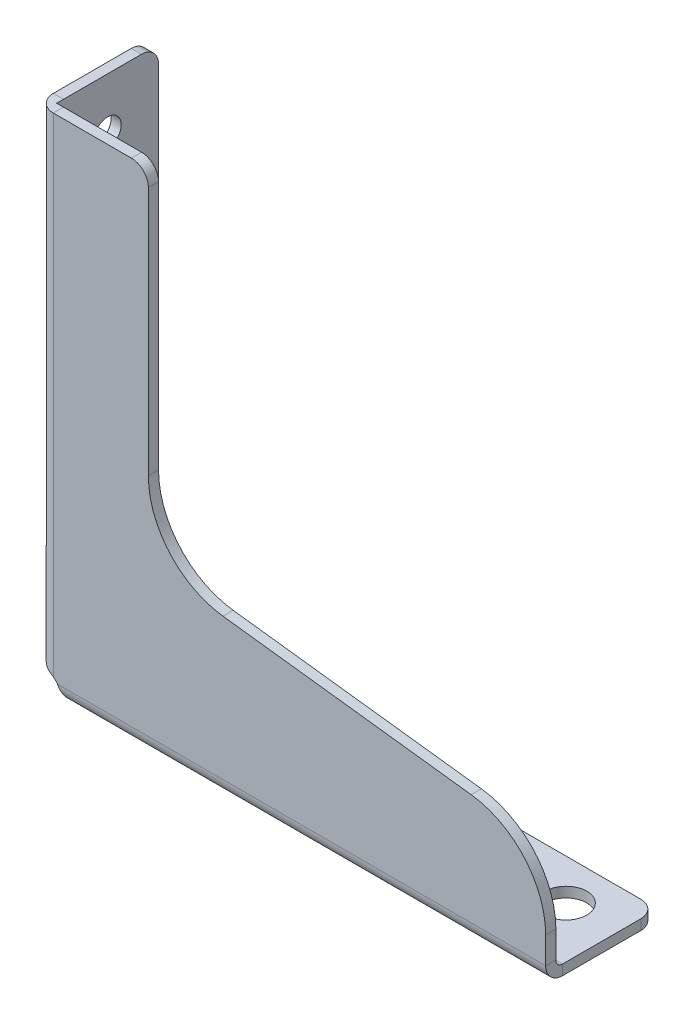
ISO-10303-21;
HEADER;
FILE_DESCRIPTION(('STEP AP214'),'2;1');
FILE_NAME('part.step','',(''),(''),'','','');
FILE_SCHEMA(('AUTOMOTIVE_DESIGN { 1 0 10303 214 1 1 1 1 }'));
ENDSEC;
DATA;
#1=APPLICATION_CONTEXT('core data for automotive mechanical design processes');
#2=APPLICATION_PROTOCOL_DEFINITION('international standard','automotive_design',2000,#1);
#3=PRODUCT_CONTEXT('',#1,'mechanical');
#4=PRODUCT('Part','Part','',(#3));
#5=PRODUCT_RELATED_PRODUCT_CATEGORY('part','',(#4));
#6=PRODUCT_DEFINITION_FORMATION('','',#4);
#7=PRODUCT_DEFINITION_CONTEXT('part definition',#1,'design');
#8=PRODUCT_DEFINITION('design','',#6,#7);
#9=PRODUCT_DEFINITION_SHAPE('','',#8);
#10=(LENGTH_UNIT() NAMED_UNIT(*) SI_UNIT(.MILLI.,.METRE.));
#11=(NAMED_UNIT(*) PLANE_ANGLE_UNIT() SI_UNIT($,.RADIAN.));
#12=(NAMED_UNIT(*) SI_UNIT($,.STERADIAN.) SOLID_ANGLE_UNIT());
#13=UNCERTAINTY_MEASURE_WITH_UNIT(LENGTH_MEASURE(1.E-05),#10,'distance_accuracy_value','');
#14=(GEOMETRIC_REPRESENTATION_CONTEXT(3) GLOBAL_UNCERTAINTY_ASSIGNED_CONTEXT((#13)) GLOBAL_UNIT_ASSIGNED_CONTEXT((#10,
#11,#12)) REPRESENTATION_CONTEXT('',''));
#15=CARTESIAN_POINT('',(0.,0.,0.));
#16=DIRECTION('',(0.,0.,1.));
#17=DIRECTION('',(1.,0.,0.));
#18=AXIS2_PLACEMENT_3D('',#15,#16,#17);
#19=CARTESIAN_POINT('',(44.1785365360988,64.4558627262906,0.));
#20=DIRECTION('',(0.,0.,-1.));
#21=DIRECTION('',(-1.,0.,0.));
#22=AXIS2_PLACEMENT_3D('',#19,#20,#21);
#23=PLANE('',#22);
#24=DIRECTION('',(-1.,0.,0.));
#25=VECTOR('',#24,1.);
#26=CARTESIAN_POINT('',(-42.3214634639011,142.971937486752,0.));
#27=LINE('',#26,#25);
#28=CARTESIAN_POINT('',(14.1785365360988,142.971937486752,0.));
#29=VERTEX_POINT('',#28);
#30=CARTESIAN_POINT('',(-8.82146346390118,142.971937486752,0.));
#31=VERTEX_POINT('',#30);
#32=EDGE_CURVE('E246',#29,#31,#27,.T.);
#33=ORIENTED_EDGE('',*,*,#32,.F.);
#34=CARTESIAN_POINT('',(14.1785365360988,137.971937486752,0.));
#35=DIRECTION('',(0.,0.,-1.));
#36=DIRECTION('',(-1.,0.,0.));
#37=AXIS2_PLACEMENT_3D('',#34,#35,#36);
#38=CIRCLE('',#37,5.);
#39=CARTESIAN_POINT('',(19.1785365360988,137.971937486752,0.));
#40=VERTEX_POINT('',#39);
#41=EDGE_CURVE('E81',#29,#40,#38,.T.);
#42=ORIENTED_EDGE('',*,*,#41,.T.);
#43=DIRECTION('',(0.,1.,0.));
#44=VECTOR('',#43,1.);
#45=CARTESIAN_POINT('',(19.1785365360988,142.971937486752,0.));
#46=LINE('',#45,#44);
#47=CARTESIAN_POINT('',(19.1785365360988,64.4558627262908,0.));
#48=VERTEX_POINT('',#47);
#49=EDGE_CURVE('E253',#48,#40,#46,.T.);
#50=ORIENTED_EDGE('',*,*,#49,.F.);
#51=CARTESIAN_POINT('',(44.1785365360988,64.4558627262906,0.));
#52=DIRECTION('',(0.,0.,-1.));
#53=DIRECTION('',(-1.,0.,0.));
#54=AXIS2_PLACEMENT_3D('',#51,#52,#53);
#55=CIRCLE('',#54,25.);
#56=CARTESIAN_POINT('',(41.1318029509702,39.6422089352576,0.));
#57=VERTEX_POINT('',#56);
#58=EDGE_CURVE('E511',#57,#48,#55,.T.);
#59=ORIENTED_EDGE('',*,*,#58,.F.);
#60=DIRECTION('',(-0.992546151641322,0.12186934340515,0.));
#61=VECTOR('',#60,1.);
#62=CARTESIAN_POINT('',(114.225270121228,30.6674596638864,0.));
#63=LINE('',#62,#61);
#64=CARTESIAN_POINT('',(114.225270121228,30.6674596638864,0.));
#65=VERTEX_POINT('',#64);
#66=EDGE_CURVE('E506',#65,#57,#63,.T.);
#67=ORIENTED_EDGE('',*,*,#66,.F.);
#68=CARTESIAN_POINT('',(111.178536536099,5.8538058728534,0.));
#69=DIRECTION('',(0.,0.,1.));
#70=DIRECTION('',(1.,0.,0.));
#71=AXIS2_PLACEMENT_3D('',#68,#69,#70);
#72=CIRCLE('',#71,25.);
#73=CARTESIAN_POINT('',(136.178536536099,5.85380587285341,0.));
#74=VERTEX_POINT('',#73);
#75=EDGE_CURVE('E501',#74,#65,#72,.T.);
#76=ORIENTED_EDGE('',*,*,#75,.F.);
#77=DIRECTION('',(0.,1.,0.));
#78=VECTOR('',#77,1.);
#79=CARTESIAN_POINT('',(136.178536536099,5.85380587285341,0.));
#80=LINE('',#79,#78);
#81=CARTESIAN_POINT('',(136.178536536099,-2.02806251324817,0.));
#82=VERTEX_POINT('',#81);
#83=EDGE_CURVE('E500',#82,#74,#80,.T.);
#84=ORIENTED_EDGE('',*,*,#83,.F.);
#85=DIRECTION('',(-1.,0.,0.));
#86=VECTOR('',#85,1.);
#87=CARTESIAN_POINT('',(44.1785365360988,-2.02806251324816,0.));
#88=LINE('',#87,#86);
#89=CARTESIAN_POINT('',(-7.58990488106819,-2.02806251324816,0.));
#90=VERTEX_POINT('',#89);
#91=EDGE_CURVE('E242',#82,#90,#88,.T.);
#92=ORIENTED_EDGE('',*,*,#91,.T.);
#93=CARTESIAN_POINT('',(-13.4731138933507,-6.67971294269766,0.));
#94=DIRECTION('',(0.,0.,-1.));
#95=DIRECTION('',(1.,0.,0.));
#96=AXIS2_PLACEMENT_3D('',#93,#94,#95);
#97=CIRCLE('',#96,7.49999999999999);
#98=CARTESIAN_POINT('',(-8.82146346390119,-0.796503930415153,0.));
#99=VERTEX_POINT('',#98);
#100=EDGE_CURVE('E240',#99,#90,#97,.T.);
#101=ORIENTED_EDGE('',*,*,#100,.F.);
#102=CARTESIAN_POINT('',(-10.8214634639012,0.575904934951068,0.));
#103=CARTESIAN_POINT('',(-10.7928154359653,0.569403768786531,0.));
#104=CARTESIAN_POINT('',(-10.7642527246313,0.562539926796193,0.));
#105=CARTESIAN_POINT('',(-10.7072961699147,0.548136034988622,0.));
#106=CARTESIAN_POINT('',(-10.6789023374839,0.540595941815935,0.));
#107=CARTESIAN_POINT('',(-10.5938589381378,0.517003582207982,0.));
#108=CARTESIAN_POINT('',(-10.5374669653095,0.500006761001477,0.));
#109=CARTESIAN_POINT('',(-10.4255973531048,0.463118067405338,0.));
#110=CARTESIAN_POINT('',(-10.3701202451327,0.443224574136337,0.));
#111=CARTESIAN_POINT('',(-10.2611947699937,0.400644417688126,0.));
#112=CARTESIAN_POINT('',(-10.2077284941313,0.378003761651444,0.));
#113=CARTESIAN_POINT('',(-10.1022841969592,0.32957262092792,0.));
#114=CARTESIAN_POINT('',(-10.0503051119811,0.303784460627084,0.));
#115=CARTESIAN_POINT('',(-9.9480741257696,0.249043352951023,0.));
#116=CARTESIAN_POINT('',(-9.89782145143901,0.220091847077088,0.));
#117=CARTESIAN_POINT('',(-9.77404094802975,0.143536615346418,0.));
#118=CARTESIAN_POINT('',(-9.70172596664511,0.0939553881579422,0.));
#119=CARTESIAN_POINT('',(-9.56176171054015,-0.0114246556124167,0.));
#120=CARTESIAN_POINT('',(-9.49411488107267,-0.0672266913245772,0.));
#121=CARTESIAN_POINT('',(-9.36312392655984,-0.184058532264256,0.));
#122=CARTESIAN_POINT('',(-9.29979512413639,-0.245105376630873,0.));
#123=CARTESIAN_POINT('',(-9.17718780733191,-0.371088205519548,0.));
#124=CARTESIAN_POINT('',(-9.11790867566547,-0.436023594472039,0.));
#125=CARTESIAN_POINT('',(-9.01883879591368,-0.550229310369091,0.));
#126=CARTESIAN_POINT('',(-8.97823419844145,-0.598801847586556,0.));
#127=CARTESIAN_POINT('',(-8.89870732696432,-0.696934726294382,0.));
#128=CARTESIAN_POINT('',(-8.85977812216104,-0.746489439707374,0.));
#129=CARTESIAN_POINT('',(-8.82146346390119,-0.796503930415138,0.));
#130=B_SPLINE_CURVE_WITH_KNOTS('',3,(#102,#103,#104,#105,#106,#107,#108,#109,#110,#111,#112,
#113,#114,#115,#116,#117,#118,#119,#120,#121,#122,#123,#124,#125,#126,#127,#128,#129),
.UNSPECIFIED.,.F.,.F.,(4,2,2,2,2,2,2,2,2,2,2,2,2,4),(0.,0.0881217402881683,0.176249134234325,
0.352871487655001,0.529593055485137,0.703682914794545,0.877644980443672,1.05152810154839,
1.31416895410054,1.57694635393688,1.84061230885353,2.10423798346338,2.29413679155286,
2.48315461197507),.UNSPECIFIED.);
#131=CARTESIAN_POINT('',(-10.8214634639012,0.575904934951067,0.));
#132=VERTEX_POINT('',#131);
#133=EDGE_CURVE('E226',#132,#99,#130,.T.);
#134=ORIENTED_EDGE('',*,*,#133,.F.);
#135=DIRECTION('',(0.,1.,0.));
#136=VECTOR('',#135,1.);
#137=CARTESIAN_POINT('',(-10.8214634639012,-7.03658751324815,0.));
#138=LINE('',#137,#136);
#139=CARTESIAN_POINT('',(-10.8214634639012,142.971937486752,0.));
#140=VERTEX_POINT('',#139);
#141=EDGE_CURVE('E832',#132,#140,#138,.T.);
#142=ORIENTED_EDGE('',*,*,#141,.T.);
#143=DIRECTION('',(1.,0.,0.));
#144=VECTOR('',#143,1.);
#145=CARTESIAN_POINT('',(-8.82146346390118,142.971937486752,0.));
#146=LINE('',#145,#144);
#147=EDGE_CURVE('E237',#140,#31,#146,.T.);
#148=ORIENTED_EDGE('',*,*,#147,.T.);
#149=EDGE_LOOP('',(#33,#42,#50,#59,#67,#76,#84,#92,#101,#134,#142,#148));
#150=FACE_BOUND('',#149,.T.);
#151=ADVANCED_FACE('F58',(#150),#23,.T.);
#152=CARTESIAN_POINT('',(-13.8214634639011,142.971937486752,-30.0022128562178));
#153=DIRECTION('',(0.,-1.,0.));
#154=DIRECTION('',(0.,0.,1.));
#155=AXIS2_PLACEMENT_3D('',#152,#153,#154);
#156=PLANE('',#155);
#157=DIRECTION('',(0.,0.,-1.));
#158=VECTOR('',#157,1.);
#159=CARTESIAN_POINT('',(-10.8214634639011,142.971937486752,-30.0022128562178));
#160=LINE('',#159,#158);
#161=CARTESIAN_POINT('',(-10.8214634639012,142.971937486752,-2.00000000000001));
#162=VERTEX_POINT('',#161);
#163=CARTESIAN_POINT('',(-10.8214634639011,142.971937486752,-25.0022128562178));
#164=VERTEX_POINT('',#163);
#165=EDGE_CURVE('E486',#162,#164,#160,.T.);
#166=ORIENTED_EDGE('',*,*,#165,.T.);
#167=DIRECTION('',(1.,0.,0.));
#168=VECTOR('',#167,1.);
#169=CARTESIAN_POINT('',(-13.8214634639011,142.971937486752,-25.0022128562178));
#170=LINE('',#169,#168);
#171=CARTESIAN_POINT('',(-13.8214634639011,142.971937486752,-25.0022128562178));
#172=VERTEX_POINT('',#171);
#173=EDGE_CURVE('E12',#164,#172,#170,.F.);
#174=ORIENTED_EDGE('',*,*,#173,.T.);
#175=DIRECTION('',(0.,0.,-1.));
#176=VECTOR('',#175,1.);
#177=CARTESIAN_POINT('',(-13.8214634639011,142.971937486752,-30.0022128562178));
#178=LINE('',#177,#176);
#179=CARTESIAN_POINT('',(-13.8214634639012,142.971937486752,-2.00000000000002));
#180=VERTEX_POINT('',#179);
#181=EDGE_CURVE('E601',#180,#172,#178,.T.);
#182=ORIENTED_EDGE('',*,*,#181,.F.);
#183=DIRECTION('',(1.,0.,0.));
#184=VECTOR('',#183,1.);
#185=CARTESIAN_POINT('',(-13.8214634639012,142.971937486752,-2.00000000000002));
#186=LINE('',#185,#184);
#187=EDGE_CURVE('E293',#180,#162,#186,.T.);
#188=ORIENTED_EDGE('',*,*,#187,.T.);
#189=EDGE_LOOP('',(#166,#174,#182,#188));
#190=FACE_BOUND('',#189,.T.);
#191=ADVANCED_FACE('F574',(#190),#156,.F.);
#192=CARTESIAN_POINT('',(-13.8214634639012,-6.67971294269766,-1.15386328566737));
#193=DIRECTION('',(1.,0.,0.));
#194=DIRECTION('',(0.,0.,-1.));
#195=AXIS2_PLACEMENT_3D('',#192,#193,#194);
#196=CYLINDRICAL_SURFACE('',#195,7.49999999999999);
#197=CARTESIAN_POINT('',(-10.8214634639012,-6.67971294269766,-1.15386328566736));
#198=DIRECTION('',(1.,0.,0.));
#199=DIRECTION('',(0.,0.,1.));
#200=AXIS2_PLACEMENT_3D('',#197,#198,#199);
#201=CIRCLE('',#200,7.49999999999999);
#202=CARTESIAN_POINT('',(-10.8214634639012,-4.02806251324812,-8.16947088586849));
#203=VERTEX_POINT('',#202);
#204=CARTESIAN_POINT('',(-10.8214634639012,0.772404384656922,-2.00000000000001));
#205=VERTEX_POINT('',#204);
#206=EDGE_CURVE('E595',#203,#205,#201,.T.);
#207=ORIENTED_EDGE('',*,*,#206,.T.);
#208=CARTESIAN_POINT('',(-13.8214634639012,0.772404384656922,-2.00000000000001));
#209=CARTESIAN_POINT('',(-10.8214634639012,0.772404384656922,-2.00000000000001));
#210=B_SPLINE_CURVE_WITH_KNOTS('',1,(#208,#209),.UNSPECIFIED.,.F.,.F.,(2,2),(0.,1.),.UNSPECIFIED.);
#211=CARTESIAN_POINT('',(-13.8214634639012,0.772404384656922,-2.00000000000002));
#212=VERTEX_POINT('',#211);
#213=EDGE_CURVE('E474',#205,#212,#210,.F.);
#214=ORIENTED_EDGE('',*,*,#213,.T.);
#215=CARTESIAN_POINT('',(-13.8214634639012,-6.67971294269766,-1.15386328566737));
#216=DIRECTION('',(1.,0.,0.));
#217=DIRECTION('',(0.,0.,1.));
#218=AXIS2_PLACEMENT_3D('',#215,#216,#217);
#219=CIRCLE('',#218,7.49999999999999);
#220=CARTESIAN_POINT('',(-13.8214634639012,-4.02806251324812,-8.1694708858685));
#221=VERTEX_POINT('',#220);
#222=EDGE_CURVE('E621',#221,#212,#219,.T.);
#223=ORIENTED_EDGE('',*,*,#222,.F.);
#224=DIRECTION('',(1.,0.,0.));
#225=VECTOR('',#224,1.);
#226=CARTESIAN_POINT('',(-13.8214634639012,-4.02806251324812,-8.1694708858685));
#227=LINE('',#226,#225);
#228=EDGE_CURVE('E618',#221,#203,#227,.T.);
#229=ORIENTED_EDGE('',*,*,#228,.T.);
#230=EDGE_LOOP('',(#207,#214,#223,#229));
#231=FACE_BOUND('',#230,.T.);
#232=ADVANCED_FACE('F578',(#231),#196,.F.);
#233=CARTESIAN_POINT('',(-13.8214634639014,64.4558627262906,56.4977871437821));
#234=DIRECTION('',(1.,0.,0.));
#235=DIRECTION('',(0.,0.,-1.));
#236=AXIS2_PLACEMENT_3D('',#233,#234,#235);
#237=PLANE('',#236);
#238=CARTESIAN_POINT('',(-13.8214634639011,127.971937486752,-15.0022128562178));
#239=DIRECTION('',(1.,0.,0.));
#240=DIRECTION('',(0.,0.,-1.));
#241=AXIS2_PLACEMENT_3D('',#238,#239,#240);
#242=CIRCLE('',#241,4.);
#243=CARTESIAN_POINT('',(-13.8214634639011,127.971937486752,-19.0022128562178));
#244=VERTEX_POINT('',#243);
#245=EDGE_CURVE('E837',#244,#244,#242,.T.);
#246=ORIENTED_EDGE('',*,*,#245,.T.);
#247=EDGE_LOOP('',(#246));
#248=FACE_BOUND('',#247,.T.);
#249=CARTESIAN_POINT('',(-13.8214634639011,47.9719374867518,-15.0022128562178));
#250=DIRECTION('',(1.,0.,0.));
#251=DIRECTION('',(0.,0.,-1.));
#252=AXIS2_PLACEMENT_3D('',#249,#250,#251);
#253=CIRCLE('',#252,3.99999999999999);
#254=CARTESIAN_POINT('',(-13.8214634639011,47.9719374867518,-19.0022128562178));
#255=VERTEX_POINT('',#254);
#256=EDGE_CURVE('E843',#255,#255,#253,.T.);
#257=ORIENTED_EDGE('',*,*,#256,.T.);
#258=EDGE_LOOP('',(#257));
#259=FACE_BOUND('',#258,.T.);
#260=DIRECTION('',(0.,-1.,0.));
#261=VECTOR('',#260,1.);
#262=CARTESIAN_POINT('',(-13.8214634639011,142.971937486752,-30.0022128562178));
#263=LINE('',#262,#261);
#264=CARTESIAN_POINT('',(-13.8214634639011,137.971937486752,-30.0022128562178));
#265=VERTEX_POINT('',#264);
#266=CARTESIAN_POINT('',(-13.8214634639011,0.971937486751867,-30.0022128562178));
#267=VERTEX_POINT('',#266);
#268=EDGE_CURVE('E606',#265,#267,#263,.T.);
#269=ORIENTED_EDGE('',*,*,#268,.T.);
#270=CARTESIAN_POINT('',(-13.8214634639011,0.971937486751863,-25.0022128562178));
#271=DIRECTION('',(1.,0.,0.));
#272=DIRECTION('',(0.,0.,-1.));
#273=AXIS2_PLACEMENT_3D('',#270,#271,#272);
#274=CIRCLE('',#273,5.);
#275=CARTESIAN_POINT('',(-13.8214634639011,-4.02806251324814,-25.0022128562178));
#276=VERTEX_POINT('',#275);
#277=EDGE_CURVE('E637',#267,#276,#274,.F.);
#278=ORIENTED_EDGE('',*,*,#277,.T.);
#279=DIRECTION('',(0.,0.,1.));
#280=VECTOR('',#279,1.);
#281=CARTESIAN_POINT('',(-13.8214634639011,-4.02806251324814,-30.0022128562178));
#282=LINE('',#281,#280);
#283=EDGE_CURVE('E629',#276,#221,#282,.T.);
#284=ORIENTED_EDGE('',*,*,#283,.T.);
#285=ORIENTED_EDGE('',*,*,#222,.T.);
#286=DIRECTION('',(0.,1.,0.));
#287=VECTOR('',#286,1.);
#288=CARTESIAN_POINT('',(-13.8214634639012,64.4558627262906,-2.00000000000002));
#289=LINE('',#288,#287);
#290=EDGE_CURVE('E620',#212,#180,#289,.T.);
#291=ORIENTED_EDGE('',*,*,#290,.T.);
#292=ORIENTED_EDGE('',*,*,#181,.T.);
#293=CARTESIAN_POINT('',(-13.8214634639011,137.971937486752,-25.0022128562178));
#294=DIRECTION('',(1.,0.,0.));
#295=DIRECTION('',(0.,0.,-1.));
#296=AXIS2_PLACEMENT_3D('',#293,#294,#295);
#297=CIRCLE('',#296,5.);
#298=EDGE_CURVE('E639',#172,#265,#297,.F.);
#299=ORIENTED_EDGE('',*,*,#298,.T.);
#300=EDGE_LOOP('',(#269,#278,#284,#285,#291,#292,#299));
#301=FACE_BOUND('',#300,.T.);
#302=ADVANCED_FACE('F583',(#248,#259,#301),#237,.F.);
#303=CARTESIAN_POINT('',(-13.8214634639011,142.971937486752,-30.0022128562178));
#304=DIRECTION('',(0.,0.,1.));
#305=DIRECTION('',(1.,0.,0.));
#306=AXIS2_PLACEMENT_3D('',#303,#304,#305);
#307=PLANE('',#306);
#308=DIRECTION('',(0.,-1.,0.));
#309=VECTOR('',#308,1.);
#310=CARTESIAN_POINT('',(-10.8214634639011,142.971937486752,-30.0022128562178));
#311=LINE('',#310,#309);
#312=CARTESIAN_POINT('',(-10.8214634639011,137.971937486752,-30.0022128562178));
#313=VERTEX_POINT('',#312);
#314=CARTESIAN_POINT('',(-10.8214634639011,0.971937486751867,-30.0022128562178));
#315=VERTEX_POINT('',#314);
#316=EDGE_CURVE('E608',#313,#315,#311,.T.);
#317=ORIENTED_EDGE('',*,*,#316,.T.);
#318=DIRECTION('',(1.,0.,0.));
#319=VECTOR('',#318,1.);
#320=CARTESIAN_POINT('',(-13.8214634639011,0.971937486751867,-30.0022128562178));
#321=LINE('',#320,#319);
#322=EDGE_CURVE('E647',#315,#267,#321,.F.);
#323=ORIENTED_EDGE('',*,*,#322,.T.);
#324=ORIENTED_EDGE('',*,*,#268,.F.);
#325=DIRECTION('',(1.,0.,0.));
#326=VECTOR('',#325,1.);
#327=CARTESIAN_POINT('',(-13.8214634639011,137.971937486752,-30.0022128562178));
#328=LINE('',#327,#326);
#329=EDGE_CURVE('E700',#265,#313,#328,.T.);
#330=ORIENTED_EDGE('',*,*,#329,.T.);
#331=EDGE_LOOP('',(#317,#323,#324,#330));
#332=FACE_BOUND('',#331,.T.);
#333=ADVANCED_FACE('F693',(#332),#307,.F.);
#334=CARTESIAN_POINT('',(-13.8214634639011,-4.02806251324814,-30.0022128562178));
#335=DIRECTION('',(0.,1.,0.));
#336=DIRECTION('',(0.,0.,-1.));
#337=AXIS2_PLACEMENT_3D('',#334,#335,#336);
#338=PLANE('',#337);
#339=ORIENTED_EDGE('',*,*,#283,.F.);
#340=DIRECTION('',(1.,0.,0.));
#341=VECTOR('',#340,1.);
#342=CARTESIAN_POINT('',(-13.8214634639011,-4.02806251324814,-25.0022128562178));
#343=LINE('',#342,#341);
#344=CARTESIAN_POINT('',(-10.8214634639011,-4.02806251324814,-25.0022128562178));
#345=VERTEX_POINT('',#344);
#346=EDGE_CURVE('E648',#276,#345,#343,.T.);
#347=ORIENTED_EDGE('',*,*,#346,.T.);
#348=DIRECTION('',(0.,0.,1.));
#349=VECTOR('',#348,1.);
#350=CARTESIAN_POINT('',(-10.8214634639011,-4.02806251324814,-30.0022128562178));
#351=LINE('',#350,#349);
#352=EDGE_CURVE('E602',#345,#203,#351,.T.);
#353=ORIENTED_EDGE('',*,*,#352,.T.);
#354=ORIENTED_EDGE('',*,*,#228,.F.);
#355=EDGE_LOOP('',(#339,#347,#353,#354));
#356=FACE_BOUND('',#355,.T.);
#357=ADVANCED_FACE('F570',(#356),#338,.F.);
#358=CARTESIAN_POINT('',(-10.8214634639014,64.4558627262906,56.4977871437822));
#359=DIRECTION('',(1.,0.,0.));
#360=DIRECTION('',(0.,0.,-1.));
#361=AXIS2_PLACEMENT_3D('',#358,#359,#360);
#362=PLANE('',#361);
#363=CARTESIAN_POINT('',(-10.8214634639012,127.971937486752,-15.0022128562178));
#364=DIRECTION('',(1.,0.,0.));
#365=DIRECTION('',(0.,0.,-1.));
#366=AXIS2_PLACEMENT_3D('',#363,#364,#365);
#367=CIRCLE('',#366,4.);
#368=CARTESIAN_POINT('',(-10.8214634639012,127.971937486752,-19.0022128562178));
#369=VERTEX_POINT('',#368);
#370=EDGE_CURVE('E834',#369,#369,#367,.T.);
#371=ORIENTED_EDGE('',*,*,#370,.F.);
#372=EDGE_LOOP('',(#371));
#373=FACE_BOUND('',#372,.T.);
#374=CARTESIAN_POINT('',(-10.8214634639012,47.9719374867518,-15.0022128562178));
#375=DIRECTION('',(1.,0.,0.));
#376=DIRECTION('',(0.,0.,-1.));
#377=AXIS2_PLACEMENT_3D('',#374,#375,#376);
#378=CIRCLE('',#377,4.);
#379=CARTESIAN_POINT('',(-10.8214634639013,47.9719374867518,-19.0022128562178));
#380=VERTEX_POINT('',#379);
#381=EDGE_CURVE('E840',#380,#380,#378,.T.);
#382=ORIENTED_EDGE('',*,*,#381,.F.);
#383=EDGE_LOOP('',(#382));
#384=FACE_BOUND('',#383,.T.);
#385=ORIENTED_EDGE('',*,*,#352,.F.);
#386=CARTESIAN_POINT('',(-10.8214634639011,0.971937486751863,-25.0022128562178));
#387=DIRECTION('',(1.,0.,0.));
#388=DIRECTION('',(0.,0.,-1.));
#389=AXIS2_PLACEMENT_3D('',#386,#387,#388);
#390=CIRCLE('',#389,5.);
#391=EDGE_CURVE('E704',#345,#315,#390,.T.);
#392=ORIENTED_EDGE('',*,*,#391,.T.);
#393=ORIENTED_EDGE('',*,*,#316,.F.);
#394=CARTESIAN_POINT('',(-10.8214634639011,137.971937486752,-25.0022128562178));
#395=DIRECTION('',(1.,0.,0.));
#396=DIRECTION('',(0.,0.,-1.));
#397=AXIS2_PLACEMENT_3D('',#394,#395,#396);
#398=CIRCLE('',#397,5.);
#399=EDGE_CURVE('E703',#313,#164,#398,.T.);
#400=ORIENTED_EDGE('',*,*,#399,.T.);
#401=ORIENTED_EDGE('',*,*,#165,.F.);
#402=DIRECTION('',(0.,0.,1.));
#403=VECTOR('',#402,1.);
#404=CARTESIAN_POINT('',(-10.8214634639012,142.971937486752,-2.00000000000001));
#405=LINE('',#404,#403);
#406=EDGE_CURVE('E829',#162,#140,#405,.T.);
#407=ORIENTED_EDGE('',*,*,#406,.T.);
#408=ORIENTED_EDGE('',*,*,#141,.F.);
#409=CARTESIAN_POINT('',(-10.8214634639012,0.772404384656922,-1.99999999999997));
#410=CARTESIAN_POINT('',(-10.8214634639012,0.775455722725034,-1.96277520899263));
#411=CARTESIAN_POINT('',(-10.8214634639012,0.778146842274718,-1.92552095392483));
#412=CARTESIAN_POINT('',(-10.8214634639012,0.782747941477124,-1.85096236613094));
#413=CARTESIAN_POINT('',(-10.8214634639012,0.784657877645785,-1.81365803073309));
#414=CARTESIAN_POINT('',(-10.8214634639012,0.78912370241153,-1.70170669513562));
#415=CARTESIAN_POINT('',(-10.821463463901,0.790417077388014,-1.62700410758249));
#416=CARTESIAN_POINT('',(-10.8214634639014,0.789478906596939,-1.47806218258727));
#417=CARTESIAN_POINT('',(-10.8214634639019,0.787267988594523,-1.40382269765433));
#418=CARTESIAN_POINT('',(-10.8214634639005,0.779530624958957,-1.25552358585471));
#419=CARTESIAN_POINT('',(-10.8214634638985,0.774004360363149,-1.18146394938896));
#420=CARTESIAN_POINT('',(-10.8214634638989,0.76110827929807,-1.04558705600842));
#421=CARTESIAN_POINT('',(-10.8214634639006,0.754181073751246,-0.983726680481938));
#422=CARTESIAN_POINT('',(-10.8214634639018,0.738495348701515,-0.860229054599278));
#423=CARTESIAN_POINT('',(-10.8214634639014,0.729736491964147,-0.798591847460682));
#424=CARTESIAN_POINT('',(-10.821463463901,0.710675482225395,-0.675539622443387));
#425=CARTESIAN_POINT('',(-10.8214634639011,0.700372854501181,-0.614124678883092));
#426=CARTESIAN_POINT('',(-10.8214634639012,0.678400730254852,-0.491052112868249));
#427=CARTESIAN_POINT('',(-10.8214634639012,0.666721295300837,-0.429396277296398));
#428=CARTESIAN_POINT('',(-10.8214634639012,0.642319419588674,-0.306316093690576));
#429=CARTESIAN_POINT('',(-10.8214634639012,0.629597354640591,-0.244891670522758));
#430=CARTESIAN_POINT('',(-10.8214634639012,0.603324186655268,-0.122286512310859));
#431=CARTESIAN_POINT('',(-10.8214634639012,0.589773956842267,-0.0611055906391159));
#432=CARTESIAN_POINT('',(-10.8214634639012,0.575904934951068,0.));
#433=B_SPLINE_CURVE_WITH_KNOTS('',3,(#409,#410,#411,#412,#413,#414,#415,#416,#417,#418,#419,
#420,#421,#422,#423,#424,#425,#426,#427,#428,#429,#430,#431,#432),.UNSPECIFIED.,.F.,.F.,(4,2,2,
2,2,2,2,2,2,2,2,4),(0.,0.112046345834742,0.224098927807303,0.448152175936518,0.670891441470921,
0.893618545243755,1.08032982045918,1.26707550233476,1.45387872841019,1.64212411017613,
1.83030193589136,2.01828465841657),.UNSPECIFIED.);
#434=EDGE_CURVE('E235',#205,#132,#433,.T.);
#435=ORIENTED_EDGE('',*,*,#434,.F.);
#436=ORIENTED_EDGE('',*,*,#206,.F.);
#437=EDGE_LOOP('',(#385,#392,#393,#400,#401,#407,#408,#435,#436));
#438=FACE_BOUND('',#437,.T.);
#439=ADVANCED_FACE('F564',(#373,#384,#438),#362,.T.);
#440=CARTESIAN_POINT('',(19.1785365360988,142.971937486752,3.));
#441=DIRECTION('',(-1.,0.,0.));
#442=DIRECTION('',(0.,-1.,0.));
#443=AXIS2_PLACEMENT_3D('',#440,#441,#442);
#444=PLANE('',#443);
#445=ORIENTED_EDGE('',*,*,#49,.T.);
#446=DIRECTION('',(0.,0.,-1.));
#447=VECTOR('',#446,1.);
#448=CARTESIAN_POINT('',(19.1785365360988,137.971937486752,3.));
#449=LINE('',#448,#447);
#450=CARTESIAN_POINT('',(19.1785365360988,137.971937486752,3.));
#451=VERTEX_POINT('',#450);
#452=EDGE_CURVE('E73',#40,#451,#449,.F.);
#453=ORIENTED_EDGE('',*,*,#452,.T.);
#454=DIRECTION('',(0.,1.,0.));
#455=VECTOR('',#454,1.);
#456=CARTESIAN_POINT('',(19.1785365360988,142.971937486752,3.));
#457=LINE('',#456,#455);
#458=CARTESIAN_POINT('',(19.1785365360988,64.4558627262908,3.));
#459=VERTEX_POINT('',#458);
#460=EDGE_CURVE('E488',#459,#451,#457,.T.);
#461=ORIENTED_EDGE('',*,*,#460,.F.);
#462=DIRECTION('',(0.,0.,-1.));
#463=VECTOR('',#462,1.);
#464=CARTESIAN_POINT('',(19.1785365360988,64.4558627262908,3.));
#465=LINE('',#464,#463);
#466=EDGE_CURVE('E513',#459,#48,#465,.T.);
#467=ORIENTED_EDGE('',*,*,#466,.T.);
#468=EDGE_LOOP('',(#445,#453,#461,#467));
#469=FACE_BOUND('',#468,.T.);
#470=ADVANCED_FACE('F562',(#469),#444,.F.);
#471=CARTESIAN_POINT('',(44.1785365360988,64.4558627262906,3.));
#472=DIRECTION('',(0.,0.,-1.));
#473=DIRECTION('',(-1.,0.,0.));
#474=AXIS2_PLACEMENT_3D('',#471,#472,#473);
#475=CYLINDRICAL_SURFACE('',#474,25.);
#476=ORIENTED_EDGE('',*,*,#58,.T.);
#477=ORIENTED_EDGE('',*,*,#466,.F.);
#478=CARTESIAN_POINT('',(44.1785365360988,64.4558627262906,3.));
#479=DIRECTION('',(0.,0.,-1.));
#480=DIRECTION('',(-1.,0.,0.));
#481=AXIS2_PLACEMENT_3D('',#478,#479,#480);
#482=CIRCLE('',#481,25.);
#483=CARTESIAN_POINT('',(41.1318029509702,39.6422089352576,3.));
#484=VERTEX_POINT('',#483);
#485=EDGE_CURVE('E490',#484,#459,#482,.T.);
#486=ORIENTED_EDGE('',*,*,#485,.F.);
#487=DIRECTION('',(0.,0.,-1.));
#488=VECTOR('',#487,1.);
#489=CARTESIAN_POINT('',(41.1318029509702,39.6422089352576,3.));
#490=LINE('',#489,#488);
#491=EDGE_CURVE('E508',#484,#57,#490,.T.);
#492=ORIENTED_EDGE('',*,*,#491,.T.);
#493=EDGE_LOOP('',(#476,#477,#486,#492));
#494=FACE_BOUND('',#493,.T.);
#495=ADVANCED_FACE('F560',(#494),#475,.F.);
#496=CARTESIAN_POINT('',(114.225270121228,30.6674596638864,3.));
#497=DIRECTION('',(-0.12186934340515,-0.992546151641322,0.));
#498=DIRECTION('',(0.992546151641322,-0.12186934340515,0.));
#499=AXIS2_PLACEMENT_3D('',#496,#497,#498);
#500=PLANE('',#499);
#501=ORIENTED_EDGE('',*,*,#66,.T.);
#502=ORIENTED_EDGE('',*,*,#491,.F.);
#503=DIRECTION('',(-0.992546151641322,0.12186934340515,0.));
#504=VECTOR('',#503,1.);
#505=CARTESIAN_POINT('',(114.225270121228,30.6674596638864,3.));
#506=LINE('',#505,#504);
#507=CARTESIAN_POINT('',(114.225270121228,30.6674596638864,3.));
#508=VERTEX_POINT('',#507);
#509=EDGE_CURVE('E492',#508,#484,#506,.T.);
#510=ORIENTED_EDGE('',*,*,#509,.F.);
#511=DIRECTION('',(0.,0.,-1.));
#512=VECTOR('',#511,1.);
#513=CARTESIAN_POINT('',(114.225270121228,30.6674596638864,3.));
#514=LINE('',#513,#512);
#515=EDGE_CURVE('E503',#508,#65,#514,.T.);
#516=ORIENTED_EDGE('',*,*,#515,.T.);
#517=EDGE_LOOP('',(#501,#502,#510,#516));
#518=FACE_BOUND('',#517,.T.);
#519=ADVANCED_FACE('F555',(#518),#500,.F.);
#520=CARTESIAN_POINT('',(111.178536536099,5.8538058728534,3.));
#521=DIRECTION('',(0.,0.,-1.));
#522=DIRECTION('',(-1.,0.,0.));
#523=AXIS2_PLACEMENT_3D('',#520,#521,#522);
#524=CYLINDRICAL_SURFACE('',#523,25.);
#525=ORIENTED_EDGE('',*,*,#75,.T.);
#526=ORIENTED_EDGE('',*,*,#515,.F.);
#527=CARTESIAN_POINT('',(111.178536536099,5.8538058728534,3.));
#528=DIRECTION('',(0.,0.,1.));
#529=DIRECTION('',(1.,0.,0.));
#530=AXIS2_PLACEMENT_3D('',#527,#528,#529);
#531=CIRCLE('',#530,25.);
#532=CARTESIAN_POINT('',(136.178536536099,5.85380587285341,3.));
#533=VERTEX_POINT('',#532);
#534=EDGE_CURVE('E494',#533,#508,#531,.T.);
#535=ORIENTED_EDGE('',*,*,#534,.F.);
#536=DIRECTION('',(0.,0.,-1.));
#537=VECTOR('',#536,1.);
#538=CARTESIAN_POINT('',(136.178536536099,5.85380587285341,3.));
#539=LINE('',#538,#537);
#540=EDGE_CURVE('E497',#533,#74,#539,.T.);
#541=ORIENTED_EDGE('',*,*,#540,.T.);
#542=EDGE_LOOP('',(#525,#526,#535,#541));
#543=FACE_BOUND('',#542,.T.);
#544=ADVANCED_FACE('F550',(#543),#524,.T.);
#545=CARTESIAN_POINT('',(136.178536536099,5.85380587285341,3.));
#546=DIRECTION('',(-1.,0.,0.));
#547=DIRECTION('',(0.,0.,1.));
#548=AXIS2_PLACEMENT_3D('',#545,#546,#547);
#549=PLANE('',#548);
#550=DIRECTION('',(0.,0.,1.));
#551=VECTOR('',#550,1.);
#552=CARTESIAN_POINT('',(136.178536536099,-2.02806251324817,3.));
#553=LINE('',#552,#551);
#554=CARTESIAN_POINT('',(136.178536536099,-2.02806251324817,3.));
#555=VERTEX_POINT('',#554);
#556=EDGE_CURVE('E524',#82,#555,#553,.T.);
#557=ORIENTED_EDGE('',*,*,#556,.F.);
#558=ORIENTED_EDGE('',*,*,#83,.T.);
#559=ORIENTED_EDGE('',*,*,#540,.F.);
#560=DIRECTION('',(0.,1.,0.));
#561=VECTOR('',#560,1.);
#562=CARTESIAN_POINT('',(136.178536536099,5.85380587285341,3.));
#563=LINE('',#562,#561);
#564=EDGE_CURVE('E496',#555,#533,#563,.T.);
#565=ORIENTED_EDGE('',*,*,#564,.F.);
#566=EDGE_LOOP('',(#557,#558,#559,#565));
#567=FACE_BOUND('',#566,.T.);
#568=ADVANCED_FACE('F547',(#567),#549,.F.);
#569=CARTESIAN_POINT('',(44.1785365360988,64.4558627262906,3.));
#570=DIRECTION('',(0.,0.,-1.));
#571=DIRECTION('',(-1.,0.,0.));
#572=AXIS2_PLACEMENT_3D('',#569,#570,#571);
#573=PLANE('',#572);
#574=ORIENTED_EDGE('',*,*,#460,.T.);
#575=CARTESIAN_POINT('',(14.1785365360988,137.971937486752,3.));
#576=DIRECTION('',(0.,0.,-1.));
#577=DIRECTION('',(-1.,0.,0.));
#578=AXIS2_PLACEMENT_3D('',#575,#576,#577);
#579=CIRCLE('',#578,5.);
#580=CARTESIAN_POINT('',(14.1785365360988,142.971937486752,3.));
#581=VERTEX_POINT('',#580);
#582=EDGE_CURVE('E66',#451,#581,#579,.F.);
#583=ORIENTED_EDGE('',*,*,#582,.T.);
#584=DIRECTION('',(-1.,0.,0.));
#585=VECTOR('',#584,1.);
#586=CARTESIAN_POINT('',(-42.3214634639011,142.971937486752,3.));
#587=LINE('',#586,#585);
#588=CARTESIAN_POINT('',(-8.82146346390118,142.971937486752,3.));
#589=VERTEX_POINT('',#588);
#590=EDGE_CURVE('E247',#581,#589,#587,.T.);
#591=ORIENTED_EDGE('',*,*,#590,.T.);
#592=DIRECTION('',(0.,1.,0.));
#593=VECTOR('',#592,1.);
#594=CARTESIAN_POINT('',(-8.82146346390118,64.4558627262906,3.));
#595=LINE('',#594,#593);
#596=CARTESIAN_POINT('',(-8.82146346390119,-0.796503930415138,3.));
#597=VERTEX_POINT('',#596);
#598=EDGE_CURVE('E427',#597,#589,#595,.T.);
#599=ORIENTED_EDGE('',*,*,#598,.F.);
#600=CARTESIAN_POINT('',(-13.4731138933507,-6.67971294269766,3.));
#601=DIRECTION('',(0.,0.,-1.));
#602=DIRECTION('',(1.,0.,0.));
#603=AXIS2_PLACEMENT_3D('',#600,#601,#602);
#604=CIRCLE('',#603,7.49999999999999);
#605=CARTESIAN_POINT('',(-7.58990488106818,-2.02806251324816,3.));
#606=VERTEX_POINT('',#605);
#607=EDGE_CURVE('E251',#597,#606,#604,.T.);
#608=ORIENTED_EDGE('',*,*,#607,.T.);
#609=DIRECTION('',(-1.,0.,0.));
#610=VECTOR('',#609,1.);
#611=CARTESIAN_POINT('',(44.1785365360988,-2.02806251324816,3.));
#612=LINE('',#611,#610);
#613=EDGE_CURVE('E284',#555,#606,#612,.T.);
#614=ORIENTED_EDGE('',*,*,#613,.F.);
#615=ORIENTED_EDGE('',*,*,#564,.T.);
#616=ORIENTED_EDGE('',*,*,#534,.T.);
#617=ORIENTED_EDGE('',*,*,#509,.T.);
#618=ORIENTED_EDGE('',*,*,#485,.T.);
#619=EDGE_LOOP('',(#574,#583,#591,#599,#608,#614,#615,#616,#617,#618));
#620=FACE_BOUND('',#619,.T.);
#621=ADVANCED_FACE('F274',(#620),#573,.F.);
#622=CARTESIAN_POINT('',(-13.4731138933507,-6.67971294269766,3.));
#623=DIRECTION('',(0.,0.,-1.));
#624=DIRECTION('',(-1.,0.,0.));
#625=AXIS2_PLACEMENT_3D('',#622,#623,#624);
#626=CYLINDRICAL_SURFACE('',#625,7.49999999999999);
#627=CARTESIAN_POINT('',(-7.58990488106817,-2.02806251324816,3.));
#628=CARTESIAN_POINT('',(-7.58990488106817,-2.02806251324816,0.));
#629=B_SPLINE_CURVE_WITH_KNOTS('',1,(#627,#628),.UNSPECIFIED.,.F.,.F.,(2,2),(0.,1.),.UNSPECIFIED.);
#630=EDGE_CURVE('E292',#606,#90,#629,.T.);
#631=ORIENTED_EDGE('',*,*,#630,.F.);
#632=ORIENTED_EDGE('',*,*,#607,.F.);
#633=CARTESIAN_POINT('',(-8.82146346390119,-0.796503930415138,0.));
#634=CARTESIAN_POINT('',(-8.82146346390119,-0.796503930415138,3.));
#635=B_SPLINE_CURVE_WITH_KNOTS('',1,(#633,#634),.UNSPECIFIED.,.F.,.F.,(2,2),(0.,1.),.UNSPECIFIED.);
#636=EDGE_CURVE('E231',#99,#597,#635,.T.);
#637=ORIENTED_EDGE('',*,*,#636,.F.);
#638=ORIENTED_EDGE('',*,*,#100,.T.);
#639=EDGE_LOOP('',(#631,#632,#637,#638));
#640=FACE_BOUND('',#639,.T.);
#641=ADVANCED_FACE('F250',(#640),#626,.F.);
#642=CARTESIAN_POINT('',(-42.3214634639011,142.971937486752,3.));
#643=DIRECTION('',(0.,-1.,0.));
#644=DIRECTION('',(1.,0.,0.));
#645=AXIS2_PLACEMENT_3D('',#642,#643,#644);
#646=PLANE('',#645);
#647=ORIENTED_EDGE('',*,*,#590,.F.);
#648=DIRECTION('',(0.,0.,-1.));
#649=VECTOR('',#648,1.);
#650=CARTESIAN_POINT('',(14.1785365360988,142.971937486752,3.));
#651=LINE('',#650,#649);
#652=EDGE_CURVE('E649',#581,#29,#651,.T.);
#653=ORIENTED_EDGE('',*,*,#652,.T.);
#654=ORIENTED_EDGE('',*,*,#32,.T.);
#655=DIRECTION('',(0.,0.,-1.));
#656=VECTOR('',#655,1.);
#657=CARTESIAN_POINT('',(-8.82146346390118,142.971937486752,3.));
#658=LINE('',#657,#656);
#659=EDGE_CURVE('E254',#589,#31,#658,.T.);
#660=ORIENTED_EDGE('',*,*,#659,.F.);
#661=EDGE_LOOP('',(#647,#653,#654,#660));
#662=FACE_BOUND('',#661,.T.);
#663=ADVANCED_FACE('F273',(#662),#646,.F.);
#664=CARTESIAN_POINT('',(-13.8214634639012,0.772404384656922,-2.00000000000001));
#665=CARTESIAN_POINT('',(-13.8214634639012,0.799819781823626,-1.16318865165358));
#666=CARTESIAN_POINT('',(-13.6132414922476,0.795231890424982,-0.421327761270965));
#667=CARTESIAN_POINT('',(-13.1720238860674,0.740799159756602,0.487158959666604));
#668=CARTESIAN_POINT('',(-13.0033359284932,0.714704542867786,0.756788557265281));
#669=CARTESIAN_POINT('',(-12.7369519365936,0.663637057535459,1.11302668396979));
#670=CARTESIAN_POINT('',(-12.6458920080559,0.644626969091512,1.22379568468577));
#671=CARTESIAN_POINT('',(-12.5079075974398,0.613130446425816,1.37859552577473));
#672=CARTESIAN_POINT('',(-12.4616776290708,0.602134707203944,1.42830550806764));
#673=CARTESIAN_POINT('',(-12.3922056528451,0.584895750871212,1.50012995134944));
#674=CARTESIAN_POINT('',(-12.3690269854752,0.579025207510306,1.52361478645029));
#675=CARTESIAN_POINT('',(-12.3342536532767,0.570033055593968,1.55816976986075));
#676=CARTESIAN_POINT('',(-12.322661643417,0.567004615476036,1.56957605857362));
#677=CARTESIAN_POINT('',(-12.305275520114,0.562415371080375,1.58651907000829));
#678=CARTESIAN_POINT('',(-12.2994804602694,0.560877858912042,1.59213900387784));
#679=CARTESIAN_POINT('',(-12.2878915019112,0.557787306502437,1.60332367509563));
#680=CARTESIAN_POINT('',(-12.283671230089,0.556658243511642,1.60738426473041));
#681=CARTESIAN_POINT('',(-11.8048369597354,0.427647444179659,2.06507698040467));
#682=CARTESIAN_POINT('',(-11.2507898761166,0.251536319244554,2.41616060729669));
#683=CARTESIAN_POINT('',(-10.0684428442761,-0.19885614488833,2.88355851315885));
#684=CARTESIAN_POINT('',(-9.44054500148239,-0.473187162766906,3.));
#685=CARTESIAN_POINT('',(-8.82146346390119,-0.796503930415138,3.));
#686=CARTESIAN_POINT('',(-10.8214634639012,0.772404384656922,-2.00000000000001));
#687=CARTESIAN_POINT('',(-10.8214634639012,0.799819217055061,-1.66528235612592));
#688=CARTESIAN_POINT('',(-10.7381746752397,0.795231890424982,-1.36853110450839));
#689=CARTESIAN_POINT('',(-10.5616876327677,0.740799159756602,-1.00513641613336));
#690=CARTESIAN_POINT('',(-10.494212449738,0.714704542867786,-0.897284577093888));
#691=CARTESIAN_POINT('',(-10.3876588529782,0.663637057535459,-0.754789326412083));
#692=CARTESIAN_POINT('',(-10.3512348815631,0.644626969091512,-0.710481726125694));
#693=CARTESIAN_POINT('',(-10.2960411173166,0.613130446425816,-0.64856178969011));
#694=CARTESIAN_POINT('',(-10.277549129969,0.602134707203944,-0.628677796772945));
#695=CARTESIAN_POINT('',(-10.2497603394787,0.584895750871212,-0.599948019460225));
#696=CARTESIAN_POINT('',(-10.2404888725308,0.579025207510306,-0.590554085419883));
#697=CARTESIAN_POINT('',(-10.2265795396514,0.570033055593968,-0.576732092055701));
#698=CARTESIAN_POINT('',(-10.2219427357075,0.567004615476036,-0.572169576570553));
#699=CARTESIAN_POINT('',(-10.2149882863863,0.562415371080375,-0.565392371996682));
#700=CARTESIAN_POINT('',(-10.2126702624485,0.560877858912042,-0.563144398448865));
#701=CARTESIAN_POINT('',(-10.2080346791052,0.557787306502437,-0.558670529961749));
#702=CARTESIAN_POINT('',(-10.2063465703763,0.556658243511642,-0.557046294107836));
#703=CARTESIAN_POINT('',(-10.0148128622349,0.42764744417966,-0.37396920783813));
#704=CARTESIAN_POINT('',(-9.79319402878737,0.251536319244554,-0.233535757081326));
#705=CARTESIAN_POINT('',(-9.32025521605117,-0.19885614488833,-0.0465765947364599));
#706=CARTESIAN_POINT('',(-9.06911622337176,-0.473160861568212,0.));
#707=CARTESIAN_POINT('',(-8.82146346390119,-0.796503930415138,0.));
#708=B_SPLINE_SURFACE_WITH_KNOTS('',1,3,((#664,#665,#666,#667,#668,#669,#670,#671,#672,#673,
#674,#675,#676,#677,#678,#679,#680,#681,#682,#683,#684,#685),(#686,#687,#688,#689,#690,#691,
#692,#693,#694,#695,#696,#697,#698,#699,#700,#701,#702,#703,#704,#705,#706,#707)),.UNSPECIFIED.,
.F.,.F.,.F.,(2,2),(4,2,2,2,2,2,2,2,2,2,4),(0.,1.),(0.,0.25,0.375,0.4375,0.46875,0.484375,
0.4921875,0.49609375,0.5,0.75,1.),.UNSPECIFIED.);
#709=CARTESIAN_POINT('',(-8.82146346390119,-0.796503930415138,3.));
#710=CARTESIAN_POINT('',(-9.44054500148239,-0.473187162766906,3.));
#711=CARTESIAN_POINT('',(-10.0684428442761,-0.19885614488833,2.88355851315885));
#712=CARTESIAN_POINT('',(-11.2507898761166,0.251536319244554,2.41616060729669));
#713=CARTESIAN_POINT('',(-11.8048369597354,0.427647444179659,2.06507698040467));
#714=CARTESIAN_POINT('',(-12.283671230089,0.556658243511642,1.60738426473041));
#715=CARTESIAN_POINT('',(-12.2878915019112,0.557787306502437,1.60332367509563));
#716=CARTESIAN_POINT('',(-12.2994804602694,0.560877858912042,1.59213900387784));
#717=CARTESIAN_POINT('',(-12.305275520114,0.562415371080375,1.58651907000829));
#718=CARTESIAN_POINT('',(-12.322661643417,0.567004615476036,1.56957605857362));
#719=CARTESIAN_POINT('',(-12.3342536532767,0.570033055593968,1.55816976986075));
#720=CARTESIAN_POINT('',(-12.3690269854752,0.579025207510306,1.52361478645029));
#721=CARTESIAN_POINT('',(-12.3922056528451,0.584895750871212,1.50012995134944));
#722=CARTESIAN_POINT('',(-12.4616776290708,0.602134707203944,1.42830550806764));
#723=CARTESIAN_POINT('',(-12.5079075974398,0.613130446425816,1.37859552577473));
#724=CARTESIAN_POINT('',(-12.6458920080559,0.644626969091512,1.22379568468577));
#725=CARTESIAN_POINT('',(-12.7369519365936,0.663637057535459,1.11302668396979));
#726=CARTESIAN_POINT('',(-13.0033359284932,0.714704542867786,0.756788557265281));
#727=CARTESIAN_POINT('',(-13.1720238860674,0.740799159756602,0.487158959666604));
#728=CARTESIAN_POINT('',(-13.6132414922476,0.795231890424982,-0.421327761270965));
#729=CARTESIAN_POINT('',(-13.8214634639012,0.799819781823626,-1.16318865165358));
#730=CARTESIAN_POINT('',(-13.8214634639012,0.772404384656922,-2.00000000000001));
#731=B_SPLINE_CURVE_WITH_KNOTS('',3,(#709,#710,#711,#712,#713,#714,#715,#716,#717,#718,#719,
#720,#721,#722,#723,#724,#725,#726,#727,#728,#729,#730),.UNSPECIFIED.,.F.,.F.,(4,2,2,2,2,2,2,2,
2,2,4),(0.,0.25,0.5,0.50390625,0.5078125,0.515625,0.53125,0.5625,0.625,0.75,1.),.UNSPECIFIED.);
#732=EDGE_CURVE('E428',#212,#597,#731,.F.);
#733=ORIENTED_EDGE('',*,*,#133,.T.);
#734=ORIENTED_EDGE('',*,*,#636,.T.);
#735=ORIENTED_EDGE('',*,*,#732,.F.);
#736=ORIENTED_EDGE('',*,*,#213,.F.);
#737=ORIENTED_EDGE('',*,*,#434,.T.);
#738=EDGE_LOOP('',(#733,#734,#735,#736,#737));
#739=FACE_BOUND('',#738,.T.);
#740=ADVANCED_FACE('F228',(#739),#708,.T.);
#741=CARTESIAN_POINT('',(-8.82146346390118,142.971937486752,-2.));
#742=DIRECTION('',(0.,1.,0.));
#743=DIRECTION('',(0.,0.,1.));
#744=AXIS2_PLACEMENT_3D('',#741,#742,#743);
#745=PLANE('',#744);
#746=ORIENTED_EDGE('',*,*,#147,.F.);
#747=ORIENTED_EDGE('',*,*,#406,.F.);
#748=ORIENTED_EDGE('',*,*,#187,.F.);
#749=CARTESIAN_POINT('',(-8.82146346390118,142.971937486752,-2.));
#750=DIRECTION('',(0.,-1.,0.));
#751=DIRECTION('',(0.,0.,-1.));
#752=AXIS2_PLACEMENT_3D('',#749,#750,#751);
#753=CIRCLE('',#752,5.);
#754=EDGE_CURVE('E420',#589,#180,#753,.T.);
#755=ORIENTED_EDGE('',*,*,#754,.F.);
#756=ORIENTED_EDGE('',*,*,#659,.T.);
#757=EDGE_LOOP('',(#746,#747,#748,#755,#756));
#758=FACE_BOUND('',#757,.T.);
#759=ADVANCED_FACE('F455',(#758),#745,.T.);
#760=CARTESIAN_POINT('',(-8.82146346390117,214.992513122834,-2.));
#761=DIRECTION('',(0.,-1.,0.));
#762=DIRECTION('',(1.,0.,0.));
#763=AXIS2_PLACEMENT_3D('',#760,#761,#762);
#764=CYLINDRICAL_SURFACE('',#763,5.);
#765=ORIENTED_EDGE('',*,*,#598,.T.);
#766=ORIENTED_EDGE('',*,*,#754,.T.);
#767=ORIENTED_EDGE('',*,*,#290,.F.);
#768=ORIENTED_EDGE('',*,*,#732,.T.);
#769=EDGE_LOOP('',(#765,#766,#767,#768));
#770=FACE_BOUND('',#769,.T.);
#771=ADVANCED_FACE('F393',(#770),#764,.T.);
#772=CARTESIAN_POINT('',(136.178536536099,-2.02806251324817,-2.));
#773=DIRECTION('',(1.,0.,0.));
#774=DIRECTION('',(0.,0.,-1.));
#775=AXIS2_PLACEMENT_3D('',#772,#773,#774);
#776=PLANE('',#775);
#777=DIRECTION('',(0.,-1.,0.));
#778=VECTOR('',#777,1.);
#779=CARTESIAN_POINT('',(136.178536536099,-7.02806251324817,-2.00000000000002));
#780=LINE('',#779,#778);
#781=CARTESIAN_POINT('',(136.178536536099,-4.02806251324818,-1.99999999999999));
#782=VERTEX_POINT('',#781);
#783=CARTESIAN_POINT('',(136.178536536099,-7.02806251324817,-2.00000000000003));
#784=VERTEX_POINT('',#783);
#785=EDGE_CURVE('E766',#782,#784,#780,.T.);
#786=ORIENTED_EDGE('',*,*,#785,.F.);
#787=CARTESIAN_POINT('',(136.178536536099,-2.02806251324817,-2.));
#788=DIRECTION('',(1.,0.,0.));
#789=DIRECTION('',(0.,1.,0.));
#790=AXIS2_PLACEMENT_3D('',#787,#788,#789);
#791=CIRCLE('',#790,2.);
#792=EDGE_CURVE('E350',#782,#82,#791,.F.);
#793=ORIENTED_EDGE('',*,*,#792,.T.);
#794=ORIENTED_EDGE('',*,*,#556,.T.);
#795=CARTESIAN_POINT('',(136.178536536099,-2.02806251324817,-2.));
#796=DIRECTION('',(-1.,0.,0.));
#797=DIRECTION('',(0.,0.,1.));
#798=AXIS2_PLACEMENT_3D('',#795,#796,#797);
#799=CIRCLE('',#798,5.);
#800=EDGE_CURVE('E764',#784,#555,#799,.T.);
#801=ORIENTED_EDGE('',*,*,#800,.F.);
#802=EDGE_LOOP('',(#786,#793,#794,#801));
#803=FACE_BOUND('',#802,.T.);
#804=ADVANCED_FACE('F392',(#803),#776,.T.);
#805=CARTESIAN_POINT('',(-7.58990488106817,-2.02806251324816,3.));
#806=CARTESIAN_POINT('',(-7.23639175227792,-2.76951494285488,3.));
#807=CARTESIAN_POINT('',(-6.9479779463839,-3.45033337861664,2.83519214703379));
#808=CARTESIAN_POINT('',(-6.60995763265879,-4.32165722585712,2.45420112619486));
#809=CARTESIAN_POINT('',(-6.51322029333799,-4.58766555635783,2.30497521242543));
#810=CARTESIAN_POINT('',(-6.39201843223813,-4.94864283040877,2.06094883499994));
#811=CARTESIAN_POINT('',(-6.35560183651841,-5.06266881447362,1.97622661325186));
#812=CARTESIAN_POINT('',(-6.30695297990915,-5.22439286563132,1.84555271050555));
#813=CARTESIAN_POINT('',(-6.29173270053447,-5.27675028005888,1.80139503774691));
#814=CARTESIAN_POINT('',(-6.27039629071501,-5.35299288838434,1.7344319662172));
#815=CARTESIAN_POINT('',(-6.26353315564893,-5.3780249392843,1.71198976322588));
#816=CARTESIAN_POINT('',(-6.25361195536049,-5.41500469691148,1.67816553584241));
#817=CARTESIAN_POINT('',(-6.2503671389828,-5.42723656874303,1.66686396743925));
#818=CARTESIAN_POINT('',(-6.2440020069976,-5.45151176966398,1.6442105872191));
#819=CARTESIAN_POINT('',(-6.24145171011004,-5.46132772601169,1.63497910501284));
#820=CARTESIAN_POINT('',(-6.12172494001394,-5.92916525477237,1.18962493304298));
#821=CARTESIAN_POINT('',(-6.04560667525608,-6.31930882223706,0.653459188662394));
#822=CARTESIAN_POINT('',(-5.9733309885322,-6.86930965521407,-0.579448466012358));
#823=CARTESIAN_POINT('',(-5.97711705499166,-7.02806251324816,-1.27539015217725));
#824=CARTESIAN_POINT('',(-6.02099656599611,-7.02806251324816,-2.00000000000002));
#825=CARTESIAN_POINT('',(-7.58990488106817,-2.02806251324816,0.));
#826=CARTESIAN_POINT('',(-7.23672574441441,-2.32436328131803,0.));
#827=CARTESIAN_POINT('',(-6.9479779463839,-2.59697085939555,-0.065923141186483));
#828=CARTESIAN_POINT('',(-6.60995763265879,-2.94550039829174,-0.218319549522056));
#829=CARTESIAN_POINT('',(-6.51322029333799,-3.05190373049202,-0.278009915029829));
#830=CARTESIAN_POINT('',(-6.39201843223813,-3.1962946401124,-0.375620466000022));
#831=CARTESIAN_POINT('',(-6.35560183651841,-3.24190503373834,-0.409509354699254));
#832=CARTESIAN_POINT('',(-6.30695297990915,-3.30659465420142,-0.46177891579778));
#833=CARTESIAN_POINT('',(-6.29173270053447,-3.32753761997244,-0.479441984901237));
#834=CARTESIAN_POINT('',(-6.27039629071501,-3.35803466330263,-0.506227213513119));
#835=CARTESIAN_POINT('',(-6.26353315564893,-3.36804748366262,-0.51520409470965));
#836=CARTESIAN_POINT('',(-6.25361195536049,-3.38283938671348,-0.528733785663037));
#837=CARTESIAN_POINT('',(-6.2503671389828,-3.38773213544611,-0.5332544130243));
#838=CARTESIAN_POINT('',(-6.2440020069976,-3.39744221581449,-0.542315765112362));
#839=CARTESIAN_POINT('',(-6.24145171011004,-3.40136859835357,-0.546008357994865));
#840=CARTESIAN_POINT('',(-6.12172494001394,-3.58850360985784,-0.724150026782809));
#841=CARTESIAN_POINT('',(-6.04560667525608,-3.74456103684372,-0.938616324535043));
#842=CARTESIAN_POINT('',(-5.9733309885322,-3.96456137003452,-1.43177938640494));
#843=CARTESIAN_POINT('',(-5.97711811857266,-4.02806251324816,-1.71016308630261));
#844=CARTESIAN_POINT('',(-6.02099656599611,-4.02806251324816,-2.00000000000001));
#845=B_SPLINE_SURFACE_WITH_KNOTS('',1,3,((#805,#806,#807,#808,#809,#810,#811,#812,#813,#814,
#815,#816,#817,#818,#819,#820,#821,#822,#823,#824),(#825,#826,#827,#828,#829,#830,#831,#832,
#833,#834,#835,#836,#837,#838,#839,#840,#841,#842,#843,#844)),.UNSPECIFIED.,.F.,.F.,.F.,(2,2),
(4,2,2,2,2,2,2,2,2,4),(0.,1.),(0.,0.25,0.375,0.4375,0.46875,0.484375,0.4921875,0.5,0.75,1.),.UNSPECIFIED.);
#846=CARTESIAN_POINT('',(-7.58990488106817,-2.02806251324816,0.));
#847=CARTESIAN_POINT('',(-7.23672574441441,-2.32436328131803,0.));
#848=CARTESIAN_POINT('',(-6.9479779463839,-2.59697085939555,-0.065923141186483));
#849=CARTESIAN_POINT('',(-6.60995763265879,-2.94550039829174,-0.218319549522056));
#850=CARTESIAN_POINT('',(-6.51322029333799,-3.05190373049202,-0.278009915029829));
#851=CARTESIAN_POINT('',(-6.39201843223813,-3.1962946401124,-0.375620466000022));
#852=CARTESIAN_POINT('',(-6.35560183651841,-3.24190503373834,-0.409509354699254));
#853=CARTESIAN_POINT('',(-6.30695297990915,-3.30659465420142,-0.46177891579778));
#854=CARTESIAN_POINT('',(-6.29173270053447,-3.32753761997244,-0.479441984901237));
#855=CARTESIAN_POINT('',(-6.27039629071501,-3.35803466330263,-0.506227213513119));
#856=CARTESIAN_POINT('',(-6.26353315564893,-3.36804748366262,-0.51520409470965));
#857=CARTESIAN_POINT('',(-6.25361195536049,-3.38283938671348,-0.528733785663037));
#858=CARTESIAN_POINT('',(-6.2503671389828,-3.38773213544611,-0.5332544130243));
#859=CARTESIAN_POINT('',(-6.2440020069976,-3.39744221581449,-0.542315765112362));
#860=CARTESIAN_POINT('',(-6.24145171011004,-3.40136859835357,-0.546008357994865));
#861=CARTESIAN_POINT('',(-6.12172494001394,-3.58850360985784,-0.724150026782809));
#862=CARTESIAN_POINT('',(-6.04560667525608,-3.74456103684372,-0.938616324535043));
#863=CARTESIAN_POINT('',(-5.9733309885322,-3.96456137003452,-1.43177938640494));
#864=CARTESIAN_POINT('',(-5.97711811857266,-4.02806251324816,-1.71016308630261));
#865=CARTESIAN_POINT('',(-6.02099656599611,-4.02806251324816,-2.00000000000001));
#866=B_SPLINE_CURVE_WITH_KNOTS('',3,(#846,#847,#848,#849,#850,#851,#852,#853,#854,#855,#856,
#857,#858,#859,#860,#861,#862,#863,#864,#865),.UNSPECIFIED.,.F.,.F.,(4,2,2,2,2,2,2,2,2,4),(0.,
0.25,0.375,0.4375,0.46875,0.484375,0.4921875,0.5,0.75,1.),.UNSPECIFIED.);
#867=CARTESIAN_POINT('',(-6.02099656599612,-4.02806251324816,-2.));
#868=VERTEX_POINT('',#867);
#869=EDGE_CURVE('E366',#90,#868,#866,.T.);
#870=CARTESIAN_POINT('',(-6.02099656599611,-4.02806251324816,-2.00000000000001));
#871=CARTESIAN_POINT('',(-6.02099656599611,-7.02806251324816,-2.00000000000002));
#872=B_SPLINE_CURVE_WITH_KNOTS('',1,(#870,#871),.UNSPECIFIED.,.F.,.F.,(2,2),(0.,1.),.UNSPECIFIED.);
#873=CARTESIAN_POINT('',(-6.02099656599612,-7.02806251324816,-2.00000000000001));
#874=VERTEX_POINT('',#873);
#875=EDGE_CURVE('E307',#874,#868,#872,.F.);
#876=CARTESIAN_POINT('',(-6.02099656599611,-7.02806251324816,-2.00000000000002));
#877=CARTESIAN_POINT('',(-5.97711705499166,-7.02806251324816,-1.27539015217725));
#878=CARTESIAN_POINT('',(-5.9733309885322,-6.86930965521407,-0.579448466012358));
#879=CARTESIAN_POINT('',(-6.04560667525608,-6.31930882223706,0.653459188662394));
#880=CARTESIAN_POINT('',(-6.12172494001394,-5.92916525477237,1.18962493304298));
#881=CARTESIAN_POINT('',(-6.24145171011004,-5.46132772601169,1.63497910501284));
#882=CARTESIAN_POINT('',(-6.2440020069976,-5.45151176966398,1.6442105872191));
#883=CARTESIAN_POINT('',(-6.2503671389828,-5.42723656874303,1.66686396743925));
#884=CARTESIAN_POINT('',(-6.25361195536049,-5.41500469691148,1.67816553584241));
#885=CARTESIAN_POINT('',(-6.26353315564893,-5.3780249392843,1.71198976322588));
#886=CARTESIAN_POINT('',(-6.27039629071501,-5.35299288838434,1.7344319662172));
#887=CARTESIAN_POINT('',(-6.29173270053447,-5.27675028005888,1.80139503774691));
#888=CARTESIAN_POINT('',(-6.30695297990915,-5.22439286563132,1.84555271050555));
#889=CARTESIAN_POINT('',(-6.35560183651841,-5.06266881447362,1.97622661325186));
#890=CARTESIAN_POINT('',(-6.39201843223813,-4.94864283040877,2.06094883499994));
#891=CARTESIAN_POINT('',(-6.51322029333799,-4.58766555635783,2.30497521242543));
#892=CARTESIAN_POINT('',(-6.60995763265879,-4.32165722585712,2.45420112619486));
#893=CARTESIAN_POINT('',(-6.9479779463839,-3.45033337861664,2.83519214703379));
#894=CARTESIAN_POINT('',(-7.23639175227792,-2.76951494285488,3.));
#895=CARTESIAN_POINT('',(-7.58990488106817,-2.02806251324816,3.));
#896=B_SPLINE_CURVE_WITH_KNOTS('',3,(#876,#877,#878,#879,#880,#881,#882,#883,#884,#885,#886,
#887,#888,#889,#890,#891,#892,#893,#894,#895),.UNSPECIFIED.,.F.,.F.,(4,2,2,2,2,2,2,2,2,4),(0.,
0.25,0.5,0.5078125,0.515625,0.53125,0.5625,0.625,0.75,1.),.UNSPECIFIED.);
#897=EDGE_CURVE('E361',#606,#874,#896,.F.);
#898=ORIENTED_EDGE('',*,*,#869,.T.);
#899=ORIENTED_EDGE('',*,*,#875,.F.);
#900=ORIENTED_EDGE('',*,*,#897,.F.);
#901=ORIENTED_EDGE('',*,*,#630,.T.);
#902=EDGE_LOOP('',(#898,#899,#900,#901));
#903=FACE_BOUND('',#902,.T.);
#904=ADVANCED_FACE('F341',(#903),#845,.T.);
#905=CARTESIAN_POINT('',(-79.6104805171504,-2.02806251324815,-2.));
#906=DIRECTION('',(1.,0.,0.));
#907=DIRECTION('',(0.,1.,0.));
#908=AXIS2_PLACEMENT_3D('',#905,#906,#907);
#909=CYLINDRICAL_SURFACE('',#908,5.);
#910=ORIENTED_EDGE('',*,*,#613,.T.);
#911=ORIENTED_EDGE('',*,*,#897,.T.);
#912=DIRECTION('',(-1.,0.,0.));
#913=VECTOR('',#912,1.);
#914=CARTESIAN_POINT('',(44.1785365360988,-7.02806251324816,-2.00000000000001));
#915=LINE('',#914,#913);
#916=EDGE_CURVE('E296',#784,#874,#915,.T.);
#917=ORIENTED_EDGE('',*,*,#916,.F.);
#918=ORIENTED_EDGE('',*,*,#800,.T.);
#919=EDGE_LOOP('',(#910,#911,#917,#918));
#920=FACE_BOUND('',#919,.T.);
#921=ADVANCED_FACE('F336',(#920),#909,.T.);
#922=CARTESIAN_POINT('',(-79.6104805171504,-2.02806251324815,-2.));
#923=DIRECTION('',(1.,0.,0.));
#924=DIRECTION('',(0.,1.,0.));
#925=AXIS2_PLACEMENT_3D('',#922,#923,#924);
#926=CYLINDRICAL_SURFACE('',#925,2.);
#927=ORIENTED_EDGE('',*,*,#91,.F.);
#928=ORIENTED_EDGE('',*,*,#792,.F.);
#929=DIRECTION('',(-1.,0.,0.));
#930=VECTOR('',#929,1.);
#931=CARTESIAN_POINT('',(44.1785365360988,-4.02806251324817,-2.));
#932=LINE('',#931,#930);
#933=EDGE_CURVE('E313',#782,#868,#932,.T.);
#934=ORIENTED_EDGE('',*,*,#933,.T.);
#935=ORIENTED_EDGE('',*,*,#869,.F.);
#936=EDGE_LOOP('',(#927,#928,#934,#935));
#937=FACE_BOUND('',#936,.T.);
#938=ADVANCED_FACE('F340',(#937),#926,.F.);
#939=CARTESIAN_POINT('',(-10.8214634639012,-7.02806251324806,-30.0022128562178));
#940=DIRECTION('',(0.,0.,1.));
#941=DIRECTION('',(-1.,0.,0.));
#942=AXIS2_PLACEMENT_3D('',#939,#940,#941);
#943=PLANE('',#942);
#944=DIRECTION('',(1.,0.,0.));
#945=VECTOR('',#944,1.);
#946=CARTESIAN_POINT('',(-10.8214634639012,-4.02806251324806,-30.0022128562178));
#947=LINE('',#946,#945);
#948=CARTESIAN_POINT('',(-5.82146346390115,-4.02806251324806,-30.0022128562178));
#949=VERTEX_POINT('',#948);
#950=CARTESIAN_POINT('',(131.178536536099,-4.02806251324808,-30.0022128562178));
#951=VERTEX_POINT('',#950);
#952=EDGE_CURVE('E731',#949,#951,#947,.T.);
#953=ORIENTED_EDGE('',*,*,#952,.T.);
#954=DIRECTION('',(0.,1.,0.));
#955=VECTOR('',#954,1.);
#956=CARTESIAN_POINT('',(131.178536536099,-7.02806251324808,-30.0022128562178));
#957=LINE('',#956,#955);
#958=CARTESIAN_POINT('',(131.178536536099,-7.02806251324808,-30.0022128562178));
#959=VERTEX_POINT('',#958);
#960=EDGE_CURVE('E716',#951,#959,#957,.F.);
#961=ORIENTED_EDGE('',*,*,#960,.T.);
#962=DIRECTION('',(1.,0.,0.));
#963=VECTOR('',#962,1.);
#964=CARTESIAN_POINT('',(-10.8214634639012,-7.02806251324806,-30.0022128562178));
#965=LINE('',#964,#963);
#966=CARTESIAN_POINT('',(-5.82146346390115,-7.02806251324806,-30.0022128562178));
#967=VERTEX_POINT('',#966);
#968=EDGE_CURVE('E746',#967,#959,#965,.T.);
#969=ORIENTED_EDGE('',*,*,#968,.F.);
#970=DIRECTION('',(0.,1.,0.));
#971=VECTOR('',#970,1.);
#972=CARTESIAN_POINT('',(-5.82146346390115,-7.02806251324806,-30.0022128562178));
#973=LINE('',#972,#971);
#974=EDGE_CURVE('E718',#967,#949,#973,.T.);
#975=ORIENTED_EDGE('',*,*,#974,.T.);
#976=EDGE_LOOP('',(#953,#961,#969,#975));
#977=FACE_BOUND('',#976,.T.);
#978=ADVANCED_FACE('F750',(#977),#943,.F.);
#979=CARTESIAN_POINT('',(-10.8214634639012,-7.02806251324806,-30.0022128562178));
#980=DIRECTION('',(1.,0.,0.));
#981=DIRECTION('',(0.,0.,1.));
#982=AXIS2_PLACEMENT_3D('',#979,#980,#981);
#983=PLANE('',#982);
#984=DIRECTION('',(0.,0.,-1.));
#985=VECTOR('',#984,1.);
#986=CARTESIAN_POINT('',(-10.8214634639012,-4.02806251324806,-30.0022128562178));
#987=LINE('',#986,#985);
#988=CARTESIAN_POINT('',(-10.8214634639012,-4.02806251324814,-8.1694708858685));
#989=VERTEX_POINT('',#988);
#990=CARTESIAN_POINT('',(-10.8214634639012,-4.02806251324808,-25.0022128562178));
#991=VERTEX_POINT('',#990);
#992=EDGE_CURVE('E729',#989,#991,#987,.T.);
#993=ORIENTED_EDGE('',*,*,#992,.T.);
#994=DIRECTION('',(0.,1.,0.));
#995=VECTOR('',#994,1.);
#996=CARTESIAN_POINT('',(-10.8214634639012,-7.02806251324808,-25.0022128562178));
#997=LINE('',#996,#995);
#998=CARTESIAN_POINT('',(-10.8214634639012,-7.02806251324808,-25.0022128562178));
#999=VERTEX_POINT('',#998);
#1000=EDGE_CURVE('E710',#991,#999,#997,.F.);
#1001=ORIENTED_EDGE('',*,*,#1000,.T.);
#1002=DIRECTION('',(0.,0.,-1.));
#1003=VECTOR('',#1002,1.);
#1004=CARTESIAN_POINT('',(-10.8214634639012,-7.02806251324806,-30.0022128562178));
#1005=LINE('',#1004,#1003);
#1006=CARTESIAN_POINT('',(-10.8214634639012,-7.02806251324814,-8.16947088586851));
#1007=VERTEX_POINT('',#1006);
#1008=EDGE_CURVE('E748',#1007,#999,#1005,.T.);
#1009=ORIENTED_EDGE('',*,*,#1008,.F.);
#1010=DIRECTION('',(0.,1.,0.));
#1011=VECTOR('',#1010,1.);
#1012=CARTESIAN_POINT('',(-10.8214634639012,-7.02806251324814,-8.16947088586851));
#1013=LINE('',#1012,#1011);
#1014=EDGE_CURVE('E740',#1007,#989,#1013,.T.);
#1015=ORIENTED_EDGE('',*,*,#1014,.T.);
#1016=EDGE_LOOP('',(#993,#1001,#1009,#1015));
#1017=FACE_BOUND('',#1016,.T.);
#1018=ADVANCED_FACE('F736',(#1017),#983,.F.);
#1019=CARTESIAN_POINT('',(44.1785365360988,-7.02806251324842,69.9817123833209));
#1020=DIRECTION('',(0.,1.,0.));
#1021=DIRECTION('',(-1.,0.,0.));
#1022=AXIS2_PLACEMENT_3D('',#1019,#1020,#1021);
#1023=PLANE('',#1022);
#1024=CARTESIAN_POINT('',(61.1785365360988,-7.02806251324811,-18.0022128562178));
#1025=DIRECTION('',(0.,1.,0.));
#1026=DIRECTION('',(0.,0.,1.));
#1027=AXIS2_PLACEMENT_3D('',#1024,#1025,#1026);
#1028=CIRCLE('',#1027,6.09999999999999);
#1029=CARTESIAN_POINT('',(61.1785365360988,-7.02806251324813,-11.9022128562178));
#1030=VERTEX_POINT('',#1029);
#1031=EDGE_CURVE('E849',#1030,#1030,#1028,.T.);
#1032=ORIENTED_EDGE('',*,*,#1031,.T.);
#1033=EDGE_LOOP('',(#1032));
#1034=FACE_BOUND('',#1033,.T.);
#1035=CARTESIAN_POINT('',(121.178536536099,-7.02806251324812,-18.0022128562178));
#1036=DIRECTION('',(0.,1.,0.));
#1037=DIRECTION('',(0.,0.,1.));
#1038=AXIS2_PLACEMENT_3D('',#1035,#1036,#1037);
#1039=CIRCLE('',#1038,6.09999999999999);
#1040=CARTESIAN_POINT('',(121.178536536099,-7.02806251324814,-11.9022128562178));
#1041=VERTEX_POINT('',#1040);
#1042=EDGE_CURVE('E775',#1041,#1041,#1039,.T.);
#1043=ORIENTED_EDGE('',*,*,#1042,.T.);
#1044=EDGE_LOOP('',(#1043));
#1045=FACE_BOUND('',#1044,.T.);
#1046=ORIENTED_EDGE('',*,*,#968,.T.);
#1047=CARTESIAN_POINT('',(131.178536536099,-7.02806251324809,-25.0022128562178));
#1048=DIRECTION('',(0.,1.,0.));
#1049=DIRECTION('',(0.,0.,1.));
#1050=AXIS2_PLACEMENT_3D('',#1047,#1048,#1049);
#1051=CIRCLE('',#1050,5.);
#1052=CARTESIAN_POINT('',(136.178536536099,-7.02806251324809,-25.0022128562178));
#1053=VERTEX_POINT('',#1052);
#1054=EDGE_CURVE('E712',#959,#1053,#1051,.F.);
#1055=ORIENTED_EDGE('',*,*,#1054,.T.);
#1056=DIRECTION('',(0.,0.,1.));
#1057=VECTOR('',#1056,1.);
#1058=CARTESIAN_POINT('',(136.178536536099,-7.02806251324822,11.3796555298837));
#1059=LINE('',#1058,#1057);
#1060=EDGE_CURVE('E299',#1053,#784,#1059,.T.);
#1061=ORIENTED_EDGE('',*,*,#1060,.T.);
#1062=ORIENTED_EDGE('',*,*,#916,.T.);
#1063=CARTESIAN_POINT('',(-13.4731138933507,-7.02806251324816,-1.15386328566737));
#1064=DIRECTION('',(0.,1.,0.));
#1065=DIRECTION('',(1.,0.,0.));
#1066=AXIS2_PLACEMENT_3D('',#1063,#1064,#1065);
#1067=CIRCLE('',#1066,7.49999999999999);
#1068=EDGE_CURVE('E298',#874,#1007,#1067,.T.);
#1069=ORIENTED_EDGE('',*,*,#1068,.T.);
#1070=ORIENTED_EDGE('',*,*,#1008,.T.);
#1071=CARTESIAN_POINT('',(-5.82146346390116,-7.02806251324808,-25.0022128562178));
#1072=DIRECTION('',(0.,1.,0.));
#1073=DIRECTION('',(0.,0.,1.));
#1074=AXIS2_PLACEMENT_3D('',#1071,#1072,#1073);
#1075=CIRCLE('',#1074,5.);
#1076=EDGE_CURVE('E714',#999,#967,#1075,.F.);
#1077=ORIENTED_EDGE('',*,*,#1076,.T.);
#1078=EDGE_LOOP('',(#1046,#1055,#1061,#1062,#1069,#1070,#1077));
#1079=FACE_BOUND('',#1078,.T.);
#1080=ADVANCED_FACE('F326',(#1034,#1045,#1079),#1023,.F.);
#1081=CARTESIAN_POINT('',(-13.4731138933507,-7.02806251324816,-1.15386328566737));
#1082=DIRECTION('',(0.,1.,0.));
#1083=DIRECTION('',(-1.,0.,0.));
#1084=AXIS2_PLACEMENT_3D('',#1081,#1082,#1083);
#1085=CYLINDRICAL_SURFACE('',#1084,7.49999999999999);
#1086=ORIENTED_EDGE('',*,*,#1068,.F.);
#1087=ORIENTED_EDGE('',*,*,#875,.T.);
#1088=CARTESIAN_POINT('',(-13.4731138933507,-4.02806251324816,-1.15386328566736));
#1089=DIRECTION('',(0.,1.,0.));
#1090=DIRECTION('',(1.,0.,0.));
#1091=AXIS2_PLACEMENT_3D('',#1088,#1089,#1090);
#1092=CIRCLE('',#1091,7.49999999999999);
#1093=EDGE_CURVE('E753',#868,#989,#1092,.T.);
#1094=ORIENTED_EDGE('',*,*,#1093,.T.);
#1095=ORIENTED_EDGE('',*,*,#1014,.F.);
#1096=EDGE_LOOP('',(#1086,#1087,#1094,#1095));
#1097=FACE_BOUND('',#1096,.T.);
#1098=ADVANCED_FACE('F315',(#1097),#1085,.F.);
#1099=CARTESIAN_POINT('',(44.1785365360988,-4.02806251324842,69.9817123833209));
#1100=DIRECTION('',(0.,1.,0.));
#1101=DIRECTION('',(-1.,0.,0.));
#1102=AXIS2_PLACEMENT_3D('',#1099,#1100,#1101);
#1103=PLANE('',#1102);
#1104=CARTESIAN_POINT('',(61.1785365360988,-4.02806251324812,-18.0022128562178));
#1105=DIRECTION('',(0.,1.,0.));
#1106=DIRECTION('',(0.,0.,1.));
#1107=AXIS2_PLACEMENT_3D('',#1104,#1105,#1106);
#1108=CIRCLE('',#1107,6.09999999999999);
#1109=CARTESIAN_POINT('',(61.1785365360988,-4.02806251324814,-11.9022128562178));
#1110=VERTEX_POINT('',#1109);
#1111=EDGE_CURVE('E846',#1110,#1110,#1108,.T.);
#1112=ORIENTED_EDGE('',*,*,#1111,.F.);
#1113=EDGE_LOOP('',(#1112));
#1114=FACE_BOUND('',#1113,.T.);
#1115=CARTESIAN_POINT('',(121.178536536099,-4.02806251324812,-18.0022128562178));
#1116=DIRECTION('',(0.,1.,0.));
#1117=DIRECTION('',(0.,0.,1.));
#1118=AXIS2_PLACEMENT_3D('',#1115,#1116,#1117);
#1119=CIRCLE('',#1118,6.10000000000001);
#1120=CARTESIAN_POINT('',(121.178536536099,-4.02806251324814,-11.9022128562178));
#1121=VERTEX_POINT('',#1120);
#1122=EDGE_CURVE('E851',#1121,#1121,#1119,.T.);
#1123=ORIENTED_EDGE('',*,*,#1122,.F.);
#1124=EDGE_LOOP('',(#1123));
#1125=FACE_BOUND('',#1124,.T.);
#1126=DIRECTION('',(0.,0.,1.));
#1127=VECTOR('',#1126,1.);
#1128=CARTESIAN_POINT('',(136.178536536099,-4.02806251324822,11.3796555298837));
#1129=LINE('',#1128,#1127);
#1130=CARTESIAN_POINT('',(136.178536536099,-4.0280625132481,-25.0022128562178));
#1131=VERTEX_POINT('',#1130);
#1132=EDGE_CURVE('E770',#1131,#782,#1129,.T.);
#1133=ORIENTED_EDGE('',*,*,#1132,.F.);
#1134=CARTESIAN_POINT('',(131.178536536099,-4.02806251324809,-25.0022128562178));
#1135=DIRECTION('',(0.,1.,0.));
#1136=DIRECTION('',(0.,0.,1.));
#1137=AXIS2_PLACEMENT_3D('',#1134,#1135,#1136);
#1138=CIRCLE('',#1137,5.);
#1139=EDGE_CURVE('E721',#1131,#951,#1138,.T.);
#1140=ORIENTED_EDGE('',*,*,#1139,.T.);
#1141=ORIENTED_EDGE('',*,*,#952,.F.);
#1142=CARTESIAN_POINT('',(-5.82146346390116,-4.02806251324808,-25.0022128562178));
#1143=DIRECTION('',(0.,1.,0.));
#1144=DIRECTION('',(0.,0.,1.));
#1145=AXIS2_PLACEMENT_3D('',#1142,#1143,#1144);
#1146=CIRCLE('',#1145,5.);
#1147=EDGE_CURVE('E535',#949,#991,#1146,.T.);
#1148=ORIENTED_EDGE('',*,*,#1147,.T.);
#1149=ORIENTED_EDGE('',*,*,#992,.F.);
#1150=ORIENTED_EDGE('',*,*,#1093,.F.);
#1151=ORIENTED_EDGE('',*,*,#933,.F.);
#1152=EDGE_LOOP('',(#1133,#1140,#1141,#1148,#1149,#1150,#1151));
#1153=FACE_BOUND('',#1152,.T.);
#1154=ADVANCED_FACE('F325',(#1114,#1125,#1153),#1103,.T.);
#1155=CARTESIAN_POINT('',(136.178536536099,-7.02806251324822,11.3796555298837));
#1156=DIRECTION('',(-1.,0.,0.));
#1157=DIRECTION('',(0.,-1.,0.));
#1158=AXIS2_PLACEMENT_3D('',#1155,#1156,#1157);
#1159=PLANE('',#1158);
#1160=ORIENTED_EDGE('',*,*,#1060,.F.);
#1161=DIRECTION('',(0.,1.,0.));
#1162=VECTOR('',#1161,1.);
#1163=CARTESIAN_POINT('',(136.178536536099,-7.02806251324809,-25.0022128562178));
#1164=LINE('',#1163,#1162);
#1165=EDGE_CURVE('E527',#1053,#1131,#1164,.T.);
#1166=ORIENTED_EDGE('',*,*,#1165,.T.);
#1167=ORIENTED_EDGE('',*,*,#1132,.T.);
#1168=ORIENTED_EDGE('',*,*,#785,.T.);
#1169=EDGE_LOOP('',(#1160,#1166,#1167,#1168));
#1170=FACE_BOUND('',#1169,.T.);
#1171=ADVANCED_FACE('F330',(#1170),#1159,.F.);
#1172=CARTESIAN_POINT('',(121.178536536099,-4.02806251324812,-18.0022128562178));
#1173=DIRECTION('',(0.,1.,0.));
#1174=DIRECTION('',(0.,0.,1.));
#1175=AXIS2_PLACEMENT_3D('',#1172,#1173,#1174);
#1176=CYLINDRICAL_SURFACE('',#1175,6.09999999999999);
#1177=ORIENTED_EDGE('',*,*,#1122,.T.);
#1178=EDGE_LOOP('',(#1177));
#1179=FACE_BOUND('',#1178,.T.);
#1180=ORIENTED_EDGE('',*,*,#1042,.F.);
#1181=EDGE_LOOP('',(#1180));
#1182=FACE_BOUND('',#1181,.T.);
#1183=ADVANCED_FACE('F334',(#1179,#1182),#1176,.F.);
#1184=CARTESIAN_POINT('',(61.1785365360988,-4.02806251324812,-18.0022128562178));
#1185=DIRECTION('',(0.,1.,0.));
#1186=DIRECTION('',(0.,0.,1.));
#1187=AXIS2_PLACEMENT_3D('',#1184,#1185,#1186);
#1188=CYLINDRICAL_SURFACE('',#1187,6.09999999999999);
#1189=ORIENTED_EDGE('',*,*,#1111,.T.);
#1190=EDGE_LOOP('',(#1189));
#1191=FACE_BOUND('',#1190,.T.);
#1192=ORIENTED_EDGE('',*,*,#1031,.F.);
#1193=EDGE_LOOP('',(#1192));
#1194=FACE_BOUND('',#1193,.T.);
#1195=ADVANCED_FACE('F789',(#1191,#1194),#1188,.F.);
#1196=CARTESIAN_POINT('',(-10.8214634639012,47.9719374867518,-15.0022128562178));
#1197=DIRECTION('',(1.,0.,0.));
#1198=DIRECTION('',(0.,0.,-1.));
#1199=AXIS2_PLACEMENT_3D('',#1196,#1197,#1198);
#1200=CYLINDRICAL_SURFACE('',#1199,3.99999999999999);
#1201=ORIENTED_EDGE('',*,*,#381,.T.);
#1202=EDGE_LOOP('',(#1201));
#1203=FACE_BOUND('',#1202,.T.);
#1204=ORIENTED_EDGE('',*,*,#256,.F.);
#1205=EDGE_LOOP('',(#1204));
#1206=FACE_BOUND('',#1205,.T.);
#1207=ADVANCED_FACE('F793',(#1203,#1206),#1200,.F.);
#1208=CARTESIAN_POINT('',(-10.8214634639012,127.971937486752,-15.0022128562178));
#1209=DIRECTION('',(1.,0.,0.));
#1210=DIRECTION('',(0.,0.,-1.));
#1211=AXIS2_PLACEMENT_3D('',#1208,#1209,#1210);
#1212=CYLINDRICAL_SURFACE('',#1211,4.);
#1213=ORIENTED_EDGE('',*,*,#370,.T.);
#1214=EDGE_LOOP('',(#1213));
#1215=FACE_BOUND('',#1214,.T.);
#1216=ORIENTED_EDGE('',*,*,#245,.F.);
#1217=EDGE_LOOP('',(#1216));
#1218=FACE_BOUND('',#1217,.T.);
#1219=ADVANCED_FACE('F677',(#1215,#1218),#1212,.F.);
#1220=CARTESIAN_POINT('',(131.178536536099,-7.02806251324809,-25.0022128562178));
#1221=DIRECTION('',(0.,1.,0.));
#1222=DIRECTION('',(0.,0.,1.));
#1223=AXIS2_PLACEMENT_3D('',#1220,#1221,#1222);
#1224=CYLINDRICAL_SURFACE('',#1223,5.);
#1225=ORIENTED_EDGE('',*,*,#1054,.F.);
#1226=ORIENTED_EDGE('',*,*,#960,.F.);
#1227=ORIENTED_EDGE('',*,*,#1139,.F.);
#1228=ORIENTED_EDGE('',*,*,#1165,.F.);
#1229=EDGE_LOOP('',(#1225,#1226,#1227,#1228));
#1230=FACE_BOUND('',#1229,.T.);
#1231=ADVANCED_FACE('F674',(#1230),#1224,.T.);
#1232=CARTESIAN_POINT('',(-5.82146346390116,-7.02806251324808,-25.0022128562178));
#1233=DIRECTION('',(0.,1.,0.));
#1234=DIRECTION('',(0.,0.,1.));
#1235=AXIS2_PLACEMENT_3D('',#1232,#1233,#1234);
#1236=CYLINDRICAL_SURFACE('',#1235,5.);
#1237=ORIENTED_EDGE('',*,*,#1076,.F.);
#1238=ORIENTED_EDGE('',*,*,#1000,.F.);
#1239=ORIENTED_EDGE('',*,*,#1147,.F.);
#1240=ORIENTED_EDGE('',*,*,#974,.F.);
#1241=EDGE_LOOP('',(#1237,#1238,#1239,#1240));
#1242=FACE_BOUND('',#1241,.T.);
#1243=ADVANCED_FACE('F669',(#1242),#1236,.T.);
#1244=CARTESIAN_POINT('',(-13.8214634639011,0.971937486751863,-25.0022128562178));
#1245=DIRECTION('',(1.,0.,0.));
#1246=DIRECTION('',(0.,0.,-1.));
#1247=AXIS2_PLACEMENT_3D('',#1244,#1245,#1246);
#1248=CYLINDRICAL_SURFACE('',#1247,5.);
#1249=ORIENTED_EDGE('',*,*,#277,.F.);
#1250=ORIENTED_EDGE('',*,*,#322,.F.);
#1251=ORIENTED_EDGE('',*,*,#391,.F.);
#1252=ORIENTED_EDGE('',*,*,#346,.F.);
#1253=EDGE_LOOP('',(#1249,#1250,#1251,#1252));
#1254=FACE_BOUND('',#1253,.T.);
#1255=ADVANCED_FACE('F646',(#1254),#1248,.T.);
#1256=CARTESIAN_POINT('',(14.1785365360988,137.971937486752,3.));
#1257=DIRECTION('',(0.,0.,-1.));
#1258=DIRECTION('',(-1.,0.,0.));
#1259=AXIS2_PLACEMENT_3D('',#1256,#1257,#1258);
#1260=CYLINDRICAL_SURFACE('',#1259,5.);
#1261=ORIENTED_EDGE('',*,*,#582,.F.);
#1262=ORIENTED_EDGE('',*,*,#452,.F.);
#1263=ORIENTED_EDGE('',*,*,#41,.F.);
#1264=ORIENTED_EDGE('',*,*,#652,.F.);
#1265=EDGE_LOOP('',(#1261,#1262,#1263,#1264));
#1266=FACE_BOUND('',#1265,.T.);
#1267=ADVANCED_FACE('F662',(#1266),#1260,.T.);
#1268=CARTESIAN_POINT('',(-13.8214634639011,137.971937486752,-25.0022128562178));
#1269=DIRECTION('',(1.,0.,0.));
#1270=DIRECTION('',(0.,0.,-1.));
#1271=AXIS2_PLACEMENT_3D('',#1268,#1269,#1270);
#1272=CYLINDRICAL_SURFACE('',#1271,5.);
#1273=ORIENTED_EDGE('',*,*,#298,.F.);
#1274=ORIENTED_EDGE('',*,*,#173,.F.);
#1275=ORIENTED_EDGE('',*,*,#399,.F.);
#1276=ORIENTED_EDGE('',*,*,#329,.F.);
#1277=EDGE_LOOP('',(#1273,#1274,#1275,#1276));
#1278=FACE_BOUND('',#1277,.T.);
#1279=ADVANCED_FACE('F60',(#1278),#1272,.T.);
#1280=CLOSED_SHELL('',(#151,#191,#232,#302,#333,#357,#439,#470,#495,#519,#544,#568,#621,#641,
#663,#740,#759,#771,#804,#904,#921,#938,#978,#1018,#1080,#1098,#1154,#1171,#1183,#1195,#1207,
#1219,#1231,#1243,#1255,#1267,#1279));
#1281=MANIFOLD_SOLID_BREP('B2',#1280);
#1282=ADVANCED_BREP_SHAPE_REPRESENTATION('',(#18,#1281),#14);
#1283=SHAPE_DEFINITION_REPRESENTATION(#9,#1282);
ENDSEC;
END-ISO-10303-21;
